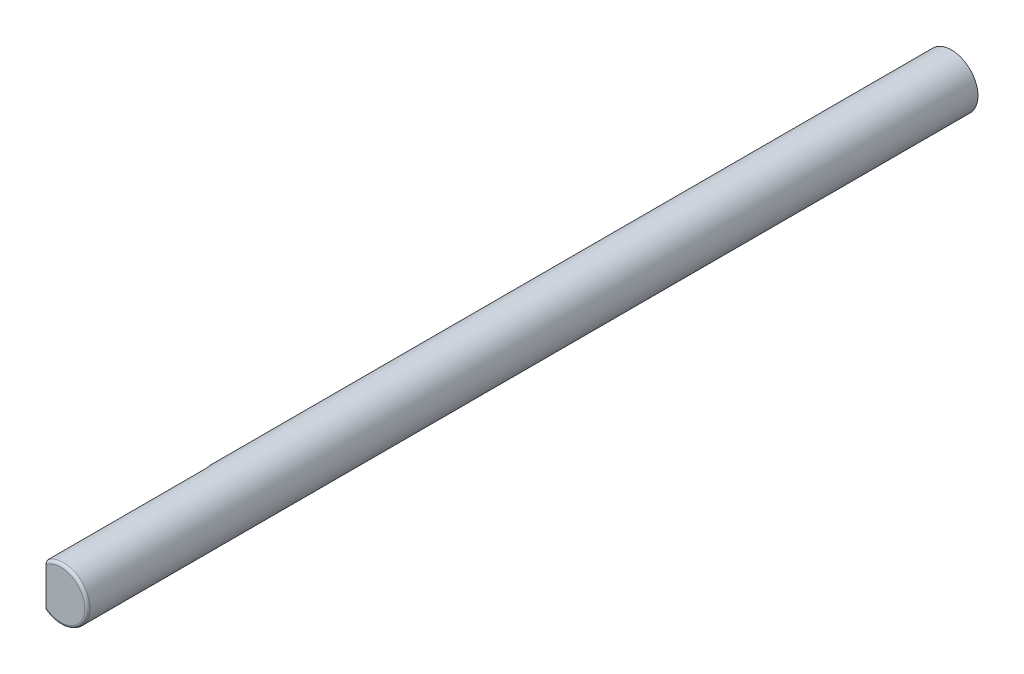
from build123d import *

# Parameters (mm, degrees)
SKETCH1_R               = 2.5
EXTRUDE1_DEPTH          = 84
FILLET1_R               = 0.25
CUT_EXTRUDE1_DEPTH      = 3
CUT_EXTRUDE1_DEPTH_BACK = 3


with BuildPart() as part:
    # Sketch1 → Extrude1 (new body)
    with BuildSketch(Plane.XY):
        with Locations(Location((0, 0, 0), (0, 0, 180))):
            Circle(SKETCH1_R)
    extrude(amount=EXTRUDE1_DEPTH)

    # Fillet1
    fillet1_edges = [part.edges().sort_by_distance(p)[0] for p in [
        (2.5, 0, 84),
    ]]
    fillet(fillet1_edges, radius=FILLET1_R)

    # Sketch2 → Cut-Extrude1 (cut, two sides: drawn at the far end of the back side and taken through both)
    with BuildSketch(Plane(origin=(0, 0, 0), x_dir=(1, 0, 0), z_dir=(0, 1, 0)).offset(-CUT_EXTRUDE1_DEPTH_BACK)):
        with BuildLine():
            Line((-1.4, -84), (-1.4, -69))
            ThreePointArc((-1.4, -69), (-1.806967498, -68.194821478), (-2.696624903, -68.045005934))
            Line((-2.696624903, -68.045005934), (-2.696624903, -84))
            Line((-2.696624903, -84), (-1.4, -84))
        make_face()
    extrude(amount=CUT_EXTRUDE1_DEPTH + CUT_EXTRUDE1_DEPTH_BACK, mode=Mode.SUBTRACT)


solid = part.part
